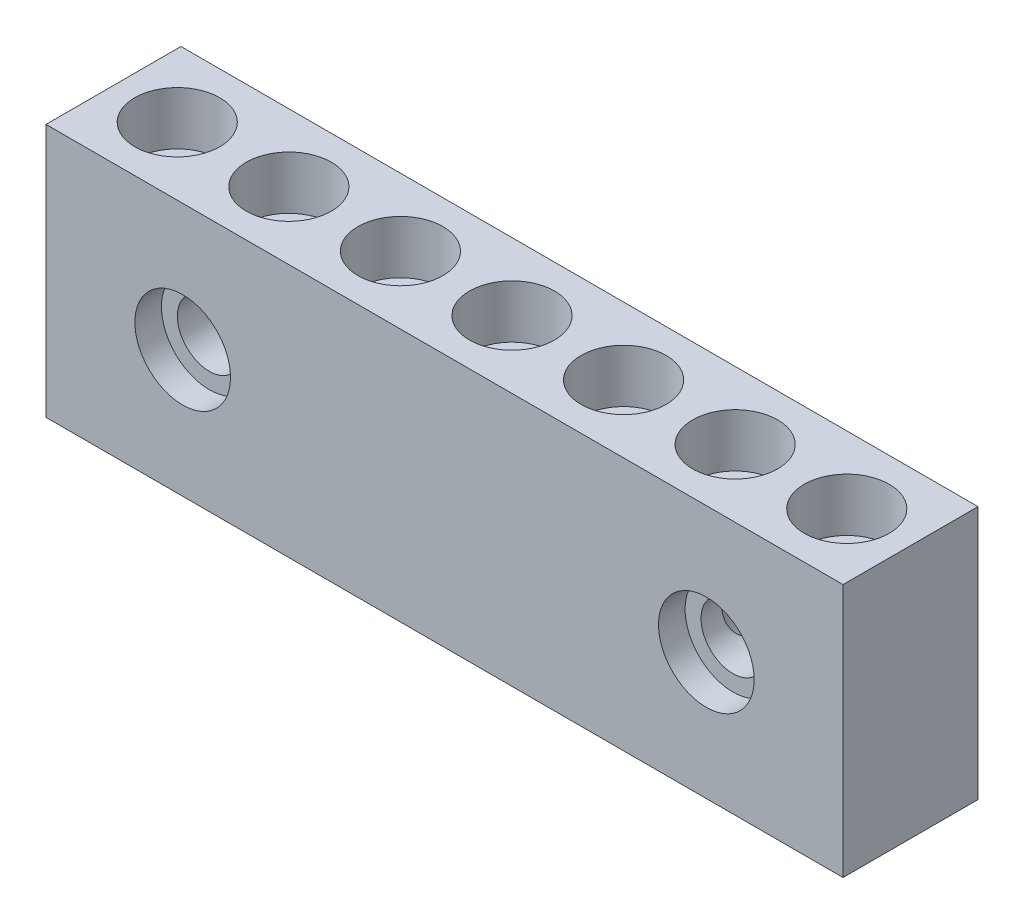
ISO-10303-21;
HEADER;
FILE_DESCRIPTION(('STEP AP214'),'2;1');
FILE_NAME('part.step','',(''),(''),'','','');
FILE_SCHEMA(('AUTOMOTIVE_DESIGN { 1 0 10303 214 1 1 1 1 }'));
ENDSEC;
DATA;
#1=APPLICATION_CONTEXT('core data for automotive mechanical design processes');
#2=APPLICATION_PROTOCOL_DEFINITION('international standard','automotive_design',2000,#1);
#3=PRODUCT_CONTEXT('',#1,'mechanical');
#4=PRODUCT('Part','Part','',(#3));
#5=PRODUCT_RELATED_PRODUCT_CATEGORY('part','',(#4));
#6=PRODUCT_DEFINITION_FORMATION('','',#4);
#7=PRODUCT_DEFINITION_CONTEXT('part definition',#1,'design');
#8=PRODUCT_DEFINITION('design','',#6,#7);
#9=PRODUCT_DEFINITION_SHAPE('','',#8);
#10=(LENGTH_UNIT() NAMED_UNIT(*) SI_UNIT(.MILLI.,.METRE.));
#11=(NAMED_UNIT(*) PLANE_ANGLE_UNIT() SI_UNIT($,.RADIAN.));
#12=(NAMED_UNIT(*) SI_UNIT($,.STERADIAN.) SOLID_ANGLE_UNIT());
#13=UNCERTAINTY_MEASURE_WITH_UNIT(LENGTH_MEASURE(1.E-05),#10,'distance_accuracy_value','');
#14=(GEOMETRIC_REPRESENTATION_CONTEXT(3) GLOBAL_UNCERTAINTY_ASSIGNED_CONTEXT((#13)) GLOBAL_UNIT_ASSIGNED_CONTEXT((#10,
#11,#12)) REPRESENTATION_CONTEXT('',''));
#15=CARTESIAN_POINT('',(0.,0.,0.));
#16=DIRECTION('',(0.,0.,1.));
#17=DIRECTION('',(1.,0.,0.));
#18=AXIS2_PLACEMENT_3D('',#15,#16,#17);
#19=CARTESIAN_POINT('',(-75.,-23.875,12.7));
#20=DIRECTION('',(1.,0.,0.));
#21=DIRECTION('',(0.,0.,-1.));
#22=AXIS2_PLACEMENT_3D('',#19,#20,#21);
#23=PLANE('',#22);
#24=DIRECTION('',(0.,-1.,0.));
#25=VECTOR('',#24,1.);
#26=CARTESIAN_POINT('',(-75.,-23.875,-12.7));
#27=LINE('',#26,#25);
#28=CARTESIAN_POINT('',(-75.,23.875,-12.7));
#29=VERTEX_POINT('',#28);
#30=CARTESIAN_POINT('',(-75.,-23.875,-12.7));
#31=VERTEX_POINT('',#30);
#32=EDGE_CURVE('E115',#29,#31,#27,.T.);
#33=ORIENTED_EDGE('',*,*,#32,.T.);
#34=DIRECTION('',(0.,0.,-1.));
#35=VECTOR('',#34,1.);
#36=CARTESIAN_POINT('',(-75.,-23.875,12.7));
#37=LINE('',#36,#35);
#38=CARTESIAN_POINT('',(-75.,-23.875,12.7));
#39=VERTEX_POINT('',#38);
#40=EDGE_CURVE('E11',#39,#31,#37,.T.);
#41=ORIENTED_EDGE('',*,*,#40,.F.);
#42=DIRECTION('',(0.,-1.,0.));
#43=VECTOR('',#42,1.);
#44=CARTESIAN_POINT('',(-75.,-23.875,12.7));
#45=LINE('',#44,#43);
#46=CARTESIAN_POINT('',(-75.,23.875,12.7));
#47=VERTEX_POINT('',#46);
#48=EDGE_CURVE('E96',#47,#39,#45,.T.);
#49=ORIENTED_EDGE('',*,*,#48,.F.);
#50=DIRECTION('',(0.,0.,-1.));
#51=VECTOR('',#50,1.);
#52=CARTESIAN_POINT('',(-75.,23.875,12.7));
#53=LINE('',#52,#51);
#54=EDGE_CURVE('E111',#47,#29,#53,.T.);
#55=ORIENTED_EDGE('',*,*,#54,.T.);
#56=EDGE_LOOP('',(#33,#41,#49,#55));
#57=FACE_BOUND('',#56,.T.);
#58=ADVANCED_FACE('F38',(#57),#23,.F.);
#59=CARTESIAN_POINT('',(75.,-23.875,12.7));
#60=DIRECTION('',(0.,1.,0.));
#61=DIRECTION('',(-1.,0.,0.));
#62=AXIS2_PLACEMENT_3D('',#59,#60,#61);
#63=PLANE('',#62);
#64=CARTESIAN_POINT('',(-42.,-23.875,0.));
#65=DIRECTION('',(0.,1.,0.));
#66=DIRECTION('',(-1.,0.,0.));
#67=AXIS2_PLACEMENT_3D('',#64,#65,#66);
#68=CIRCLE('',#67,4.00000000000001);
#69=CARTESIAN_POINT('',(-46.,-23.875,0.));
#70=VERTEX_POINT('',#69);
#71=EDGE_CURVE('E136',#70,#70,#68,.F.);
#72=ORIENTED_EDGE('',*,*,#71,.F.);
#73=EDGE_LOOP('',(#72));
#74=FACE_BOUND('',#73,.T.);
#75=CARTESIAN_POINT('',(-21.,-23.875,0.));
#76=DIRECTION('',(0.,1.,0.));
#77=DIRECTION('',(-1.,0.,0.));
#78=AXIS2_PLACEMENT_3D('',#75,#76,#77);
#79=CIRCLE('',#78,4.00000000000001);
#80=CARTESIAN_POINT('',(-25.,-23.875,0.));
#81=VERTEX_POINT('',#80);
#82=EDGE_CURVE('E568',#81,#81,#79,.F.);
#83=ORIENTED_EDGE('',*,*,#82,.F.);
#84=EDGE_LOOP('',(#83));
#85=FACE_BOUND('',#84,.T.);
#86=CARTESIAN_POINT('',(0.,-23.875,0.));
#87=DIRECTION('',(0.,1.,0.));
#88=DIRECTION('',(-1.,0.,0.));
#89=AXIS2_PLACEMENT_3D('',#86,#87,#88);
#90=CIRCLE('',#89,4.00000000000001);
#91=CARTESIAN_POINT('',(-4.00000000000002,-23.875,0.));
#92=VERTEX_POINT('',#91);
#93=EDGE_CURVE('E581',#92,#92,#90,.F.);
#94=ORIENTED_EDGE('',*,*,#93,.F.);
#95=EDGE_LOOP('',(#94));
#96=FACE_BOUND('',#95,.T.);
#97=CARTESIAN_POINT('',(21.,-23.875,0.));
#98=DIRECTION('',(0.,1.,0.));
#99=DIRECTION('',(-1.,0.,0.));
#100=AXIS2_PLACEMENT_3D('',#97,#98,#99);
#101=CIRCLE('',#100,4.00000000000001);
#102=CARTESIAN_POINT('',(17.,-23.875,0.));
#103=VERTEX_POINT('',#102);
#104=EDGE_CURVE('E631',#103,#103,#101,.F.);
#105=ORIENTED_EDGE('',*,*,#104,.F.);
#106=EDGE_LOOP('',(#105));
#107=FACE_BOUND('',#106,.T.);
#108=CARTESIAN_POINT('',(42.,-23.875,0.));
#109=DIRECTION('',(0.,1.,0.));
#110=DIRECTION('',(-1.,0.,0.));
#111=AXIS2_PLACEMENT_3D('',#108,#109,#110);
#112=CIRCLE('',#111,4.00000000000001);
#113=CARTESIAN_POINT('',(38.,-23.875,0.));
#114=VERTEX_POINT('',#113);
#115=EDGE_CURVE('E575',#114,#114,#112,.F.);
#116=ORIENTED_EDGE('',*,*,#115,.F.);
#117=EDGE_LOOP('',(#116));
#118=FACE_BOUND('',#117,.T.);
#119=CARTESIAN_POINT('',(63.,-23.875,0.));
#120=DIRECTION('',(0.,1.,0.));
#121=DIRECTION('',(-1.,0.,0.));
#122=AXIS2_PLACEMENT_3D('',#119,#120,#121);
#123=CIRCLE('',#122,4.00000000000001);
#124=CARTESIAN_POINT('',(59.,-23.875,0.));
#125=VERTEX_POINT('',#124);
#126=EDGE_CURVE('E545',#125,#125,#123,.F.);
#127=ORIENTED_EDGE('',*,*,#126,.F.);
#128=EDGE_LOOP('',(#127));
#129=FACE_BOUND('',#128,.T.);
#130=CARTESIAN_POINT('',(-63.,-23.875,0.));
#131=DIRECTION('',(0.,1.,0.));
#132=DIRECTION('',(-1.,0.,0.));
#133=AXIS2_PLACEMENT_3D('',#130,#131,#132);
#134=CIRCLE('',#133,4.00000000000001);
#135=CARTESIAN_POINT('',(-67.,-23.875,0.));
#136=VERTEX_POINT('',#135);
#137=EDGE_CURVE('E556',#136,#136,#134,.F.);
#138=ORIENTED_EDGE('',*,*,#137,.F.);
#139=EDGE_LOOP('',(#138));
#140=FACE_BOUND('',#139,.T.);
#141=DIRECTION('',(1.,0.,0.));
#142=VECTOR('',#141,1.);
#143=CARTESIAN_POINT('',(75.,-23.875,-12.7));
#144=LINE('',#143,#142);
#145=CARTESIAN_POINT('',(75.,-23.875,-12.7));
#146=VERTEX_POINT('',#145);
#147=EDGE_CURVE('E101',#31,#146,#144,.T.);
#148=ORIENTED_EDGE('',*,*,#147,.T.);
#149=DIRECTION('',(0.,0.,-1.));
#150=VECTOR('',#149,1.);
#151=CARTESIAN_POINT('',(75.,-23.875,12.7));
#152=LINE('',#151,#150);
#153=CARTESIAN_POINT('',(75.,-23.875,12.7));
#154=VERTEX_POINT('',#153);
#155=EDGE_CURVE('E52',#154,#146,#152,.T.);
#156=ORIENTED_EDGE('',*,*,#155,.F.);
#157=DIRECTION('',(1.,0.,0.));
#158=VECTOR('',#157,1.);
#159=CARTESIAN_POINT('',(75.,-23.875,12.7));
#160=LINE('',#159,#158);
#161=EDGE_CURVE('E91',#39,#154,#160,.T.);
#162=ORIENTED_EDGE('',*,*,#161,.F.);
#163=ORIENTED_EDGE('',*,*,#40,.T.);
#164=EDGE_LOOP('',(#148,#156,#162,#163));
#165=FACE_BOUND('',#164,.T.);
#166=ADVANCED_FACE('F100',(#74,#85,#96,#107,#118,#129,#140,#165),#63,.F.);
#167=CARTESIAN_POINT('',(75.,-23.875,12.7));
#168=DIRECTION('',(-1.,0.,0.));
#169=DIRECTION('',(0.,0.,1.));
#170=AXIS2_PLACEMENT_3D('',#167,#168,#169);
#171=PLANE('',#170);
#172=DIRECTION('',(0.,1.,0.));
#173=VECTOR('',#172,1.);
#174=CARTESIAN_POINT('',(75.,-23.875,-12.7));
#175=LINE('',#174,#173);
#176=CARTESIAN_POINT('',(75.,23.875,-12.7));
#177=VERTEX_POINT('',#176);
#178=EDGE_CURVE('E78',#146,#177,#175,.T.);
#179=ORIENTED_EDGE('',*,*,#178,.T.);
#180=DIRECTION('',(0.,0.,-1.));
#181=VECTOR('',#180,1.);
#182=CARTESIAN_POINT('',(75.,23.875,12.7));
#183=LINE('',#182,#181);
#184=CARTESIAN_POINT('',(75.,23.875,12.7));
#185=VERTEX_POINT('',#184);
#186=EDGE_CURVE('E103',#185,#177,#183,.T.);
#187=ORIENTED_EDGE('',*,*,#186,.F.);
#188=DIRECTION('',(0.,1.,0.));
#189=VECTOR('',#188,1.);
#190=CARTESIAN_POINT('',(75.,-23.875,12.7));
#191=LINE('',#190,#189);
#192=EDGE_CURVE('E94',#154,#185,#191,.T.);
#193=ORIENTED_EDGE('',*,*,#192,.F.);
#194=ORIENTED_EDGE('',*,*,#155,.T.);
#195=EDGE_LOOP('',(#179,#187,#193,#194));
#196=FACE_BOUND('',#195,.T.);
#197=ADVANCED_FACE('F105',(#196),#171,.F.);
#198=CARTESIAN_POINT('',(75.,23.875,12.7));
#199=DIRECTION('',(0.,-1.,0.));
#200=DIRECTION('',(1.,0.,0.));
#201=AXIS2_PLACEMENT_3D('',#198,#199,#200);
#202=PLANE('',#201);
#203=CARTESIAN_POINT('',(-42.,23.875,0.));
#204=DIRECTION('',(0.,1.,0.));
#205=DIRECTION('',(-1.,0.,0.));
#206=AXIS2_PLACEMENT_3D('',#203,#204,#205);
#207=CIRCLE('',#206,7.99999999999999);
#208=CARTESIAN_POINT('',(-50.,23.875,0.));
#209=VERTEX_POINT('',#208);
#210=EDGE_CURVE('E587',#209,#209,#207,.T.);
#211=ORIENTED_EDGE('',*,*,#210,.F.);
#212=EDGE_LOOP('',(#211));
#213=FACE_BOUND('',#212,.T.);
#214=CARTESIAN_POINT('',(-21.,23.875,0.));
#215=DIRECTION('',(0.,1.,0.));
#216=DIRECTION('',(-1.,0.,0.));
#217=AXIS2_PLACEMENT_3D('',#214,#215,#216);
#218=CIRCLE('',#217,7.99999999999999);
#219=CARTESIAN_POINT('',(-29.,23.875,0.));
#220=VERTEX_POINT('',#219);
#221=EDGE_CURVE('E588',#220,#220,#218,.T.);
#222=ORIENTED_EDGE('',*,*,#221,.F.);
#223=EDGE_LOOP('',(#222));
#224=FACE_BOUND('',#223,.T.);
#225=CARTESIAN_POINT('',(0.,23.875,0.));
#226=DIRECTION('',(0.,1.,0.));
#227=DIRECTION('',(-1.,0.,0.));
#228=AXIS2_PLACEMENT_3D('',#225,#226,#227);
#229=CIRCLE('',#228,7.99999999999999);
#230=CARTESIAN_POINT('',(-8.,23.875,0.));
#231=VERTEX_POINT('',#230);
#232=EDGE_CURVE('E541',#231,#231,#229,.T.);
#233=ORIENTED_EDGE('',*,*,#232,.F.);
#234=EDGE_LOOP('',(#233));
#235=FACE_BOUND('',#234,.T.);
#236=CARTESIAN_POINT('',(21.,23.875,0.));
#237=DIRECTION('',(0.,1.,0.));
#238=DIRECTION('',(-1.,0.,0.));
#239=AXIS2_PLACEMENT_3D('',#236,#237,#238);
#240=CIRCLE('',#239,7.99999999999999);
#241=CARTESIAN_POINT('',(13.,23.875,0.));
#242=VERTEX_POINT('',#241);
#243=EDGE_CURVE('E542',#242,#242,#240,.T.);
#244=ORIENTED_EDGE('',*,*,#243,.F.);
#245=EDGE_LOOP('',(#244));
#246=FACE_BOUND('',#245,.T.);
#247=CARTESIAN_POINT('',(42.,23.875,0.));
#248=DIRECTION('',(0.,1.,0.));
#249=DIRECTION('',(-1.,0.,0.));
#250=AXIS2_PLACEMENT_3D('',#247,#248,#249);
#251=CIRCLE('',#250,7.99999999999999);
#252=CARTESIAN_POINT('',(34.,23.875,0.));
#253=VERTEX_POINT('',#252);
#254=EDGE_CURVE('E566',#253,#253,#251,.T.);
#255=ORIENTED_EDGE('',*,*,#254,.F.);
#256=EDGE_LOOP('',(#255));
#257=FACE_BOUND('',#256,.T.);
#258=CARTESIAN_POINT('',(63.,23.875,0.));
#259=DIRECTION('',(0.,1.,0.));
#260=DIRECTION('',(-1.,0.,0.));
#261=AXIS2_PLACEMENT_3D('',#258,#259,#260);
#262=CIRCLE('',#261,7.99999999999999);
#263=CARTESIAN_POINT('',(55.,23.875,0.));
#264=VERTEX_POINT('',#263);
#265=EDGE_CURVE('E551',#264,#264,#262,.T.);
#266=ORIENTED_EDGE('',*,*,#265,.F.);
#267=EDGE_LOOP('',(#266));
#268=FACE_BOUND('',#267,.T.);
#269=CARTESIAN_POINT('',(-63.,23.875,0.));
#270=DIRECTION('',(0.,1.,0.));
#271=DIRECTION('',(-1.,0.,0.));
#272=AXIS2_PLACEMENT_3D('',#269,#270,#271);
#273=CIRCLE('',#272,7.99999999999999);
#274=CARTESIAN_POINT('',(-71.,23.875,0.));
#275=VERTEX_POINT('',#274);
#276=EDGE_CURVE('E518',#275,#275,#273,.T.);
#277=ORIENTED_EDGE('',*,*,#276,.F.);
#278=EDGE_LOOP('',(#277));
#279=FACE_BOUND('',#278,.T.);
#280=DIRECTION('',(-1.,0.,0.));
#281=VECTOR('',#280,1.);
#282=CARTESIAN_POINT('',(75.,23.875,-12.7));
#283=LINE('',#282,#281);
#284=EDGE_CURVE('E84',#177,#29,#283,.T.);
#285=ORIENTED_EDGE('',*,*,#284,.T.);
#286=ORIENTED_EDGE('',*,*,#54,.F.);
#287=DIRECTION('',(-1.,0.,0.));
#288=VECTOR('',#287,1.);
#289=CARTESIAN_POINT('',(75.,23.875,12.7));
#290=LINE('',#289,#288);
#291=EDGE_CURVE('E61',#185,#47,#290,.T.);
#292=ORIENTED_EDGE('',*,*,#291,.F.);
#293=ORIENTED_EDGE('',*,*,#186,.T.);
#294=EDGE_LOOP('',(#285,#286,#292,#293));
#295=FACE_BOUND('',#294,.T.);
#296=ADVANCED_FACE('F250',(#213,#224,#235,#246,#257,#268,#279,#295),#202,.F.);
#297=CARTESIAN_POINT('',(0.,0.,12.7));
#298=DIRECTION('',(0.,0.,1.));
#299=DIRECTION('',(1.,0.,0.));
#300=AXIS2_PLACEMENT_3D('',#297,#298,#299);
#301=PLANE('',#300);
#302=CARTESIAN_POINT('',(-49.275,-0.00500000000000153,12.7));
#303=DIRECTION('',(0.,0.,1.));
#304=DIRECTION('',(1.,0.,0.));
#305=AXIS2_PLACEMENT_3D('',#302,#303,#304);
#306=CIRCLE('',#305,9.00000000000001);
#307=CARTESIAN_POINT('',(-40.275,-0.00500000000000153,12.7));
#308=VERTEX_POINT('',#307);
#309=EDGE_CURVE('E527',#308,#308,#306,.T.);
#310=ORIENTED_EDGE('',*,*,#309,.F.);
#311=EDGE_LOOP('',(#310));
#312=FACE_BOUND('',#311,.T.);
#313=CARTESIAN_POINT('',(49.275,-0.00500000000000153,12.7));
#314=DIRECTION('',(0.,0.,1.));
#315=DIRECTION('',(1.,0.,0.));
#316=AXIS2_PLACEMENT_3D('',#313,#314,#315);
#317=CIRCLE('',#316,9.);
#318=CARTESIAN_POINT('',(58.275,-0.00500000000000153,12.7));
#319=VERTEX_POINT('',#318);
#320=EDGE_CURVE('E535',#319,#319,#317,.T.);
#321=ORIENTED_EDGE('',*,*,#320,.F.);
#322=EDGE_LOOP('',(#321));
#323=FACE_BOUND('',#322,.T.);
#324=ORIENTED_EDGE('',*,*,#48,.T.);
#325=ORIENTED_EDGE('',*,*,#161,.T.);
#326=ORIENTED_EDGE('',*,*,#192,.T.);
#327=ORIENTED_EDGE('',*,*,#291,.T.);
#328=EDGE_LOOP('',(#324,#325,#326,#327));
#329=FACE_BOUND('',#328,.T.);
#330=ADVANCED_FACE('F92',(#312,#323,#329),#301,.T.);
#331=CARTESIAN_POINT('',(0.,0.,-12.7));
#332=DIRECTION('',(0.,0.,1.));
#333=DIRECTION('',(1.,0.,0.));
#334=AXIS2_PLACEMENT_3D('',#331,#332,#333);
#335=PLANE('',#334);
#336=CARTESIAN_POINT('',(-49.275,-0.00500000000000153,-12.7));
#337=DIRECTION('',(0.,0.,1.));
#338=DIRECTION('',(1.,0.,0.));
#339=AXIS2_PLACEMENT_3D('',#336,#337,#338);
#340=CIRCLE('',#339,6.);
#341=CARTESIAN_POINT('',(-43.275,-0.00500000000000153,-12.7));
#342=VERTEX_POINT('',#341);
#343=EDGE_CURVE('E521',#342,#342,#340,.F.);
#344=ORIENTED_EDGE('',*,*,#343,.F.);
#345=EDGE_LOOP('',(#344));
#346=FACE_BOUND('',#345,.T.);
#347=CARTESIAN_POINT('',(49.275,-0.00500000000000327,-12.7));
#348=DIRECTION('',(0.,0.,1.));
#349=DIRECTION('',(1.,0.,0.));
#350=AXIS2_PLACEMENT_3D('',#347,#348,#349);
#351=CIRCLE('',#350,6.);
#352=CARTESIAN_POINT('',(55.275,-0.00500000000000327,-12.7));
#353=VERTEX_POINT('',#352);
#354=EDGE_CURVE('E505',#353,#353,#351,.F.);
#355=ORIENTED_EDGE('',*,*,#354,.F.);
#356=EDGE_LOOP('',(#355));
#357=FACE_BOUND('',#356,.T.);
#358=ORIENTED_EDGE('',*,*,#32,.F.);
#359=ORIENTED_EDGE('',*,*,#284,.F.);
#360=ORIENTED_EDGE('',*,*,#178,.F.);
#361=ORIENTED_EDGE('',*,*,#147,.F.);
#362=EDGE_LOOP('',(#358,#359,#360,#361));
#363=FACE_BOUND('',#362,.T.);
#364=ADVANCED_FACE('F238',(#346,#357,#363),#335,.F.);
#365=CARTESIAN_POINT('',(49.275,-0.00500000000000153,7.7));
#366=DIRECTION('',(0.,0.,1.));
#367=DIRECTION('',(1.,0.,0.));
#368=AXIS2_PLACEMENT_3D('',#365,#366,#367);
#369=CYLINDRICAL_SURFACE('',#368,9.);
#370=CARTESIAN_POINT('',(49.275,-0.00500000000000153,7.7));
#371=DIRECTION('',(0.,0.,1.));
#372=DIRECTION('',(1.,0.,0.));
#373=AXIS2_PLACEMENT_3D('',#370,#371,#372);
#374=CIRCLE('',#373,9.);
#375=CARTESIAN_POINT('',(58.275,-0.00500000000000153,7.7));
#376=VERTEX_POINT('',#375);
#377=EDGE_CURVE('E531',#376,#376,#374,.T.);
#378=ORIENTED_EDGE('',*,*,#377,.F.);
#379=EDGE_LOOP('',(#378));
#380=FACE_BOUND('',#379,.T.);
#381=ORIENTED_EDGE('',*,*,#320,.T.);
#382=EDGE_LOOP('',(#381));
#383=FACE_BOUND('',#382,.T.);
#384=ADVANCED_FACE('F240',(#380,#383),#369,.F.);
#385=CARTESIAN_POINT('',(49.275,-0.00500000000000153,7.7));
#386=DIRECTION('',(0.,0.,1.));
#387=DIRECTION('',(1.,0.,0.));
#388=AXIS2_PLACEMENT_3D('',#385,#386,#387);
#389=PLANE('',#388);
#390=CARTESIAN_POINT('',(49.275,-0.00500000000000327,7.7));
#391=DIRECTION('',(0.,0.,1.));
#392=DIRECTION('',(1.,0.,0.));
#393=AXIS2_PLACEMENT_3D('',#390,#391,#392);
#394=CIRCLE('',#393,6.);
#395=CARTESIAN_POINT('',(55.275,-0.00500000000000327,7.7));
#396=VERTEX_POINT('',#395);
#397=EDGE_CURVE('E508',#396,#396,#394,.T.);
#398=ORIENTED_EDGE('',*,*,#397,.F.);
#399=EDGE_LOOP('',(#398));
#400=FACE_BOUND('',#399,.T.);
#401=ORIENTED_EDGE('',*,*,#377,.T.);
#402=EDGE_LOOP('',(#401));
#403=FACE_BOUND('',#402,.T.);
#404=ADVANCED_FACE('F247',(#400,#403),#389,.T.);
#405=CARTESIAN_POINT('',(-49.275,-0.00500000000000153,7.7));
#406=DIRECTION('',(0.,0.,1.));
#407=DIRECTION('',(1.,0.,0.));
#408=AXIS2_PLACEMENT_3D('',#405,#406,#407);
#409=CYLINDRICAL_SURFACE('',#408,9.00000000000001);
#410=CARTESIAN_POINT('',(-49.275,-0.00500000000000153,7.7));
#411=DIRECTION('',(0.,0.,1.));
#412=DIRECTION('',(1.,0.,0.));
#413=AXIS2_PLACEMENT_3D('',#410,#411,#412);
#414=CIRCLE('',#413,9.00000000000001);
#415=CARTESIAN_POINT('',(-40.275,-0.00500000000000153,7.7));
#416=VERTEX_POINT('',#415);
#417=EDGE_CURVE('E119',#416,#416,#414,.T.);
#418=ORIENTED_EDGE('',*,*,#417,.F.);
#419=EDGE_LOOP('',(#418));
#420=FACE_BOUND('',#419,.T.);
#421=ORIENTED_EDGE('',*,*,#309,.T.);
#422=EDGE_LOOP('',(#421));
#423=FACE_BOUND('',#422,.T.);
#424=ADVANCED_FACE('F286',(#420,#423),#409,.F.);
#425=CARTESIAN_POINT('',(-49.275,-0.00500000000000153,7.7));
#426=DIRECTION('',(0.,0.,1.));
#427=DIRECTION('',(1.,0.,0.));
#428=AXIS2_PLACEMENT_3D('',#425,#426,#427);
#429=PLANE('',#428);
#430=CARTESIAN_POINT('',(-49.275,-0.00500000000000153,7.7));
#431=DIRECTION('',(0.,0.,1.));
#432=DIRECTION('',(1.,0.,0.));
#433=AXIS2_PLACEMENT_3D('',#430,#431,#432);
#434=CIRCLE('',#433,6.);
#435=CARTESIAN_POINT('',(-43.275,-0.00500000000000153,7.7));
#436=VERTEX_POINT('',#435);
#437=EDGE_CURVE('E514',#436,#436,#434,.T.);
#438=ORIENTED_EDGE('',*,*,#437,.F.);
#439=EDGE_LOOP('',(#438));
#440=FACE_BOUND('',#439,.T.);
#441=ORIENTED_EDGE('',*,*,#417,.T.);
#442=EDGE_LOOP('',(#441));
#443=FACE_BOUND('',#442,.T.);
#444=ADVANCED_FACE('F295',(#440,#443),#429,.T.);
#445=CARTESIAN_POINT('',(49.275,-0.00500000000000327,-29.6705627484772));
#446=DIRECTION('',(0.,0.,1.));
#447=DIRECTION('',(1.,0.,0.));
#448=AXIS2_PLACEMENT_3D('',#445,#446,#447);
#449=CYLINDRICAL_SURFACE('',#448,6.);
#450=CARTESIAN_POINT('',(43.275,-0.0050000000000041,-3.7913552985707));
#451=CARTESIAN_POINT('',(43.2750012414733,-0.175367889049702,-3.79135752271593));
#452=CARTESIAN_POINT('',(43.2822641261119,-0.34576269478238,-3.7889363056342));
#453=CARTESIAN_POINT('',(43.3112478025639,-0.68521380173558,-3.77900237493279));
#454=CARTESIAN_POINT('',(43.3329731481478,-0.85426966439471,-3.77148805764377));
#455=CARTESIAN_POINT('',(43.3906445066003,-1.18961348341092,-3.75060652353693));
#456=CARTESIAN_POINT('',(43.4265932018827,-1.35590091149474,-3.73723820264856));
#457=CARTESIAN_POINT('',(43.5122507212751,-1.68412459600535,-3.70340668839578));
#458=CARTESIAN_POINT('',(43.5619545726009,-1.84606240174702,-3.68294605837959));
#459=CARTESIAN_POINT('',(43.6607146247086,-2.12540670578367,-3.63925538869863));
#460=CARTESIAN_POINT('',(43.707006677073,-2.24409154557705,-3.61789922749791));
#461=CARTESIAN_POINT('',(43.806540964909,-2.4772478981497,-3.56924088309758));
#462=CARTESIAN_POINT('',(43.8597817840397,-2.59172026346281,-3.54193991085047));
#463=CARTESIAN_POINT('',(43.9724420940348,-2.81543408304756,-3.48045712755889));
#464=CARTESIAN_POINT('',(44.0318513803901,-2.92468375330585,-3.44628659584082));
#465=CARTESIAN_POINT('',(44.1559928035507,-3.13723551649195,-3.37001453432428));
#466=CARTESIAN_POINT('',(44.2207239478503,-3.24053871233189,-3.32791448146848));
#467=CARTESIAN_POINT('',(44.3419118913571,-3.42175766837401,-3.24343109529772));
#468=CARTESIAN_POINT('',(44.3976814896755,-3.50083247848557,-3.20254360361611));
#469=CARTESIAN_POINT('',(44.5111159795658,-3.65390080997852,-3.11439453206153));
#470=CARTESIAN_POINT('',(44.5687805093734,-3.72789529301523,-3.06713416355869));
#471=CARTESIAN_POINT('',(44.6850385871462,-3.87032061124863,-2.96589036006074));
#472=CARTESIAN_POINT('',(44.7436318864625,-3.93875290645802,-2.91190869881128));
#473=CARTESIAN_POINT('',(44.8606814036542,-4.06966501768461,-2.7970029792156));
#474=CARTESIAN_POINT('',(44.9191376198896,-4.1321447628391,-2.7360788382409));
#475=CARTESIAN_POINT('',(45.0350796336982,-4.2511771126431,-2.60688823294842));
#476=CARTESIAN_POINT('',(45.0925577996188,-4.3076930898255,-2.53858108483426));
#477=CARTESIAN_POINT('',(45.2049614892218,-4.4141702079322,-2.39510423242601));
#478=CARTESIAN_POINT('',(45.2598872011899,-4.46413183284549,-2.3199350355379));
#479=CARTESIAN_POINT('',(45.3659900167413,-4.55743174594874,-2.16311650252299));
#480=CARTESIAN_POINT('',(45.4171671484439,-4.60077008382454,-2.08146721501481));
#481=CARTESIAN_POINT('',(45.5146554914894,-4.68087344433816,-1.91225722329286));
#482=CARTESIAN_POINT('',(45.5609671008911,-4.71763900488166,-1.8246970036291));
#483=CARTESIAN_POINT('',(45.6434123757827,-4.78140144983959,-1.65337934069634));
#484=CARTESIAN_POINT('',(45.68010048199,-4.80900692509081,-1.57011371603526));
#485=CARTESIAN_POINT('',(45.7481458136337,-4.85918256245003,-1.39992954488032));
#486=CARTESIAN_POINT('',(45.779501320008,-4.8817511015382,-1.31300983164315));
#487=CARTESIAN_POINT('',(45.8363561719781,-4.92200546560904,-1.13621752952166));
#488=CARTESIAN_POINT('',(45.8618578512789,-4.93969323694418,-1.04634613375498));
#489=CARTESIAN_POINT('',(45.9066445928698,-4.97037195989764,-0.864247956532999));
#490=CARTESIAN_POINT('',(45.9259273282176,-4.98336115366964,-0.772020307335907));
#491=CARTESIAN_POINT('',(45.957696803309,-5.00458616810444,-0.587565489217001));
#492=CARTESIAN_POINT('',(45.970298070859,-5.0129022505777,-0.495367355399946));
#493=CARTESIAN_POINT('',(45.9890577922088,-5.02522867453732,-0.310023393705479));
#494=CARTESIAN_POINT('',(45.995213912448,-5.02923745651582,-0.216877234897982));
#495=CARTESIAN_POINT('',(46.003841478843,-5.03487823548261,0.0629388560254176));
#496=CARTESIAN_POINT('',(45.996505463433,-5.03014632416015,0.250179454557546));
#497=CARTESIAN_POINT('',(45.9558000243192,-5.00334740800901,0.622082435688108));
#498=CARTESIAN_POINT('',(45.9222092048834,-4.98113296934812,0.806709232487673));
#499=CARTESIAN_POINT('',(45.8306202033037,-4.91817802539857,1.16652065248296));
#500=CARTESIAN_POINT('',(45.7726255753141,-4.87744021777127,1.3417066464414));
#501=CARTESIAN_POINT('',(45.6361375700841,-4.77635244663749,1.67660905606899));
#502=CARTESIAN_POINT('',(45.5577618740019,-4.71611460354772,1.83640729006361));
#503=CARTESIAN_POINT('',(45.3855227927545,-4.57493500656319,2.13735642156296));
#504=CARTESIAN_POINT('',(45.2916628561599,-4.49399786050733,2.2785114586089));
#505=CARTESIAN_POINT('',(45.094952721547,-4.31140746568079,2.53928279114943));
#506=CARTESIAN_POINT('',(44.9921081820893,-4.20976720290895,2.6589125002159));
#507=CARTESIAN_POINT('',(44.7842034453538,-3.98695328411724,2.87590673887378));
#508=CARTESIAN_POINT('',(44.6791426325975,-3.86577413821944,2.97326499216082));
#509=CARTESIAN_POINT('',(44.4658913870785,-3.59719471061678,3.15280368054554));
#510=CARTESIAN_POINT('',(44.3579891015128,-3.44855887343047,3.23346353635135));
#511=CARTESIAN_POINT('',(44.1526532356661,-3.13497120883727,3.37366184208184));
#512=CARTESIAN_POINT('',(44.0552258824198,-2.97000978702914,3.4331877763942));
#513=CARTESIAN_POINT('',(43.9121198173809,-2.69805364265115,3.51389849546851));
#514=CARTESIAN_POINT('',(43.8616527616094,-2.59516251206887,3.54077776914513));
#515=CARTESIAN_POINT('',(43.7662855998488,-2.38560901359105,3.58930380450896));
#516=CARTESIAN_POINT('',(43.7213860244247,-2.27894628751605,3.61095006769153));
#517=CARTESIAN_POINT('',(43.6375857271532,-2.06243764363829,3.64971855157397));
#518=CARTESIAN_POINT('',(43.5986880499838,-1.95259014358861,3.66683847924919));
#519=CARTESIAN_POINT('',(43.5272269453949,-1.73032175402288,3.6971723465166));
#520=CARTESIAN_POINT('',(43.4946641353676,-1.61790061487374,3.71038590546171));
#521=CARTESIAN_POINT('',(43.4300440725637,-1.36752830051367,3.7358296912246));
#522=CARTESIAN_POINT('',(43.3994867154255,-1.22910948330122,3.74729019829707));
#523=CARTESIAN_POINT('',(43.3482170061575,-0.950176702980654,3.7660395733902));
#524=CARTESIAN_POINT('',(43.3275058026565,-0.809662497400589,3.77332795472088));
#525=CARTESIAN_POINT('',(43.2960856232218,-0.527280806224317,3.7842356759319));
#526=CARTESIAN_POINT('',(43.2853835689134,-0.385412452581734,3.78785247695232));
#527=CARTESIAN_POINT('',(43.2740863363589,-0.101230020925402,3.7916668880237));
#528=CARTESIAN_POINT('',(43.2734913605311,0.0410840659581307,3.7918644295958));
#529=CARTESIAN_POINT('',(43.2829073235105,0.341054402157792,3.78869144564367));
#530=CARTESIAN_POINT('',(43.2940955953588,0.498671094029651,3.78492487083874));
#531=CARTESIAN_POINT('',(43.3288420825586,0.812383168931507,3.77286567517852));
#532=CARTESIAN_POINT('',(43.3524020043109,0.968478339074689,3.76457242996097));
#533=CARTESIAN_POINT('',(43.4116531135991,1.27795761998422,3.74275727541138));
#534=CARTESIAN_POINT('',(43.4473422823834,1.43134217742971,3.72923623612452));
#535=CARTESIAN_POINT('',(43.5304495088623,1.7341888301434,3.69590726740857));
#536=CARTESIAN_POINT('',(43.577864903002,1.88365180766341,3.67610076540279));
#537=CARTESIAN_POINT('',(43.6738928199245,2.14993141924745,3.633221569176));
#538=CARTESIAN_POINT('',(43.7206314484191,2.26763620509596,3.61144773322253));
#539=CARTESIAN_POINT('',(43.8209334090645,2.49880134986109,3.56192792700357));
#540=CARTESIAN_POINT('',(43.8744955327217,2.61226245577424,3.53418301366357));
#541=CARTESIAN_POINT('',(43.9876808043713,2.83396567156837,3.47178543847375));
#542=CARTESIAN_POINT('',(44.0472958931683,2.94221444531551,3.43714190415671));
#543=CARTESIAN_POINT('',(44.1717078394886,3.15274387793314,3.35991683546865));
#544=CARTESIAN_POINT('',(44.2365036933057,3.25502568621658,3.31733683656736));
#545=CARTESIAN_POINT('',(44.3577555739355,3.43450438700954,3.2319385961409));
#546=CARTESIAN_POINT('',(44.4135531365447,3.5128546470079,3.19060502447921));
#547=CARTESIAN_POINT('',(44.5269478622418,3.66446258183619,3.10156867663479));
#548=CARTESIAN_POINT('',(44.5845446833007,3.73772121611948,3.05386710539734));
#549=CARTESIAN_POINT('',(44.7005651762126,3.87866788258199,2.95176473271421));
#550=CARTESIAN_POINT('',(44.7589885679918,3.94635775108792,2.89736615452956));
#551=CARTESIAN_POINT('',(44.8756017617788,4.07579453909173,2.7816647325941));
#552=CARTESIAN_POINT('',(44.9337915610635,4.13754138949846,2.72036180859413));
#553=CARTESIAN_POINT('',(45.049102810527,4.25511898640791,2.59047382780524));
#554=CARTESIAN_POINT('',(45.1062162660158,4.31091394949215,2.52184919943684));
#555=CARTESIAN_POINT('',(45.2178132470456,4.41598536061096,2.37780902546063));
#556=CARTESIAN_POINT('',(45.2722969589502,4.46526227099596,2.30239396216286));
#557=CARTESIAN_POINT('',(45.3774573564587,4.55724115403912,2.14516351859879));
#558=CARTESIAN_POINT('',(45.4281339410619,4.59994295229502,2.06334796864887));
#559=CARTESIAN_POINT('',(45.52458072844,4.67882745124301,1.89389333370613));
#560=CARTESIAN_POINT('',(45.5703513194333,4.71501066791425,1.80625471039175));
#561=CARTESIAN_POINT('',(45.6518406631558,4.77779193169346,1.63468079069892));
#562=CARTESIAN_POINT('',(45.6881044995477,4.80498087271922,1.55121916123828));
#563=CARTESIAN_POINT('',(45.7552727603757,4.85434760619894,1.3806974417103));
#564=CARTESIAN_POINT('',(45.7861754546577,4.87652378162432,1.29363620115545));
#565=CARTESIAN_POINT('',(45.8421063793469,4.91601760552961,1.11661612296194));
#566=CARTESIAN_POINT('',(45.8671369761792,4.93333721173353,1.02665846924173));
#567=CARTESIAN_POINT('',(45.9109723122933,4.96330178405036,0.844441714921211));
#568=CARTESIAN_POINT('',(45.9297747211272,4.97594500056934,0.752181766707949));
#569=CARTESIAN_POINT('',(45.9606115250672,4.99651685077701,0.567593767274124));
#570=CARTESIAN_POINT('',(45.9727521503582,5.00451960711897,0.475291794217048));
#571=CARTESIAN_POINT('',(45.9905797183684,5.01622328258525,0.289787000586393));
#572=CARTESIAN_POINT('',(45.9962643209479,5.01992264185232,0.196583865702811));
#573=CARTESIAN_POINT('',(46.0034707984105,5.02463573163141,-0.0833326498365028));
#574=CARTESIAN_POINT('',(45.9951776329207,5.01928543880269,-0.270546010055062));
#575=CARTESIAN_POINT('',(45.9525849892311,4.99121659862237,-0.642182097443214));
#576=CARTESIAN_POINT('',(45.9180672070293,4.96835224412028,-0.826568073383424));
#577=CARTESIAN_POINT('',(45.8247199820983,4.90404896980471,-1.18570590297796));
#578=CARTESIAN_POINT('',(45.7658942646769,4.86261289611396,-1.36045922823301));
#579=CARTESIAN_POINT('',(45.627924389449,4.7600954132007,-1.69428246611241));
#580=CARTESIAN_POINT('',(45.548902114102,4.69913131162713,-1.85343879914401));
#581=CARTESIAN_POINT('',(45.3755904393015,4.55648449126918,-2.15298140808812));
#582=CARTESIAN_POINT('',(45.2813042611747,4.47480614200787,-2.2933716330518));
#583=CARTESIAN_POINT('',(45.0839308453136,4.29070658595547,-2.55263518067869));
#584=CARTESIAN_POINT('',(44.9808436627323,4.18828550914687,-2.67150863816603));
#585=CARTESIAN_POINT('',(44.7726972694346,3.96396343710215,-2.88697737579));
#586=CARTESIAN_POINT('',(44.667637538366,3.84205723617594,-2.98356668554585));
#587=CARTESIAN_POINT('',(44.4544170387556,3.57182198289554,-3.16172853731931));
#588=CARTESIAN_POINT('',(44.3465677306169,3.42222987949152,-3.24174305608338));
#589=CARTESIAN_POINT('',(44.141554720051,3.10677770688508,-3.38070037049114));
#590=CARTESIAN_POINT('',(44.044398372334,2.94090658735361,-3.43962872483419));
#591=CARTESIAN_POINT('',(43.9017934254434,2.66741328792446,-3.51949351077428));
#592=CARTESIAN_POINT('',(43.8515025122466,2.563863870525,-3.54609119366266));
#593=CARTESIAN_POINT('',(43.7565631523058,2.35300866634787,-3.59406721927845));
#594=CARTESIAN_POINT('',(43.7119153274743,2.24570246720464,-3.61544498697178));
#595=CARTESIAN_POINT('',(43.6287057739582,2.02796707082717,-3.65368499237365));
#596=CARTESIAN_POINT('',(43.5901449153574,1.91753742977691,-3.67054658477));
#597=CARTESIAN_POINT('',(43.5194212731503,1.69412989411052,-3.70038267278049));
#598=CARTESIAN_POINT('',(43.4872589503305,1.58115181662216,-3.71335688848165));
#599=CARTESIAN_POINT('',(43.4281087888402,1.34744771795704,-3.73651784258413));
#600=CARTESIAN_POINT('',(43.4014630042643,1.22661799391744,-3.74653134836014));
#601=CARTESIAN_POINT('',(43.3556652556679,0.983331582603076,-3.76334506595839));
#602=CARTESIAN_POINT('',(43.3365132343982,0.860874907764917,-3.77014530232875));
#603=CARTESIAN_POINT('',(43.305808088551,0.614786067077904,-3.7808902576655));
#604=CARTESIAN_POINT('',(43.2942611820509,0.491153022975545,-3.78483264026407));
#605=CARTESIAN_POINT('',(43.2788563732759,0.243351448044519,-3.79006445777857));
#606=CARTESIAN_POINT('',(43.2749990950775,0.11918287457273,-3.79135367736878));
#607=CARTESIAN_POINT('',(43.275,-0.0050000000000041,-3.7913552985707));
#608=B_SPLINE_CURVE_WITH_KNOTS('',3,(#450,#451,#452,#453,#454,#455,#456,#457,#458,#459,#460,
#461,#462,#463,#464,#465,#466,#467,#468,#469,#470,#471,#472,#473,#474,#475,#476,#477,#478,#479,
#480,#481,#482,#483,#484,#485,#486,#487,#488,#489,#490,#491,#492,#493,#494,#495,#496,#497,#498,
#499,#500,#501,#502,#503,#504,#505,#506,#507,#508,#509,#510,#511,#512,#513,#514,#515,#516,#517,
#518,#519,#520,#521,#522,#523,#524,#525,#526,#527,#528,#529,#530,#531,#532,#533,#534,#535,#536,
#537,#538,#539,#540,#541,#542,#543,#544,#545,#546,#547,#548,#549,#550,#551,#552,#553,#554,#555,
#556,#557,#558,#559,#560,#561,#562,#563,#564,#565,#566,#567,#568,#569,#570,#571,#572,#573,#574,
#575,#576,#577,#578,#579,#580,#581,#582,#583,#584,#585,#586,#587,#588,#589,#590,#591,#592,#593,
#594,#595,#596,#597,#598,#599,#600,#601,#602,#603,#604,#605,#606,#607),.UNSPECIFIED.,.T.,.F.,(4,
2,2,2,2,2,2,2,2,2,2,2,2,2,2,2,2,2,2,2,2,2,2,2,2,2,2,2,2,2,2,2,2,2,2,2,2,2,2,2,2,2,2,2,2,2,2,2,2,
2,2,2,2,2,2,2,2,2,2,2,2,2,2,2,2,2,2,2,2,2,2,2,2,2,2,2,2,2,4),(0.,0.510978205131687,
1.02211737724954,1.53335299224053,2.04440402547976,2.43156208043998,2.81864134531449,
3.20509016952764,3.59146708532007,3.90630192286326,4.22107700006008,4.53576918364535,
4.85046511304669,5.16699329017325,5.4834980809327,5.80000049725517,6.11647699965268,
6.40138691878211,6.68638851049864,6.97127628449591,7.25627053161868,7.53620733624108,
7.81624546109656,8.37573772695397,8.93999953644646,9.50417919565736,10.0651709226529,
10.6260378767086,11.1865541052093,11.7472280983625,12.3467801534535,12.9466866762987,
13.2995497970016,13.6524465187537,14.0055216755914,14.3586312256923,14.784833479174,
15.2110854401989,15.6376319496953,16.0641870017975,16.5378014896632,17.0114813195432,
17.4850823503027,17.9585759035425,18.343727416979,18.7288108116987,19.1133880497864,
19.4978909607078,19.8116635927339,20.1253769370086,20.438986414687,20.7525995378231,
21.0680028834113,21.3833838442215,21.6987731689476,22.0141375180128,22.2987155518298,
22.583385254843,22.8679400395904,23.1526011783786,23.4325803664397,23.7126610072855,
24.2722395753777,24.8365280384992,25.4007300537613,25.9616044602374,26.5223606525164,
27.0831133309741,27.6440160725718,28.2448390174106,28.8460726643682,29.2002457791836,
29.5544578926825,29.9087205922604,30.2630087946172,30.6351347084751,31.0072577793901,
31.3796847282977,31.7521419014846),.UNSPECIFIED.);
#609=CARTESIAN_POINT('',(43.275,-0.0050000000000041,-3.7913552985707));
#610=VERTEX_POINT('',#609);
#611=EDGE_CURVE('E41',#610,#610,#608,.T.);
#612=ORIENTED_EDGE('',*,*,#611,.T.);
#613=EDGE_LOOP('',(#612));
#614=FACE_BOUND('',#613,.T.);
#615=ORIENTED_EDGE('',*,*,#354,.T.);
#616=EDGE_LOOP('',(#615));
#617=FACE_BOUND('',#616,.T.);
#618=ORIENTED_EDGE('',*,*,#397,.T.);
#619=EDGE_LOOP('',(#618));
#620=FACE_BOUND('',#619,.T.);
#621=ADVANCED_FACE('F226',(#614,#617,#620),#449,.F.);
#622=CARTESIAN_POINT('',(-49.275,-0.00500000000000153,-29.6705627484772));
#623=DIRECTION('',(0.,0.,1.));
#624=DIRECTION('',(1.,0.,0.));
#625=AXIS2_PLACEMENT_3D('',#622,#623,#624);
#626=CYLINDRICAL_SURFACE('',#625,6.);
#627=CARTESIAN_POINT('',(-43.275,-0.00500000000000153,-3.79135529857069));
#628=CARTESIAN_POINT('',(-43.2750012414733,0.165367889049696,-3.79135752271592));
#629=CARTESIAN_POINT('',(-43.282264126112,0.335762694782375,-3.78893630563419));
#630=CARTESIAN_POINT('',(-43.311247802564,0.675213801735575,-3.77900237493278));
#631=CARTESIAN_POINT('',(-43.3329731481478,0.844269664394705,-3.77148805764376));
#632=CARTESIAN_POINT('',(-43.3906445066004,1.17961348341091,-3.75060652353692));
#633=CARTESIAN_POINT('',(-43.4265932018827,1.34590091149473,-3.73723820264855));
#634=CARTESIAN_POINT('',(-43.5122507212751,1.67412459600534,-3.70340668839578));
#635=CARTESIAN_POINT('',(-43.561954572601,1.83606240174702,-3.68294605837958));
#636=CARTESIAN_POINT('',(-43.6607146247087,2.11540670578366,-3.63925538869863));
#637=CARTESIAN_POINT('',(-43.707006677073,2.23409154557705,-3.61789922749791));
#638=CARTESIAN_POINT('',(-43.806540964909,2.46724789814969,-3.56924088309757));
#639=CARTESIAN_POINT('',(-43.8597817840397,2.5817202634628,-3.54193991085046));
#640=CARTESIAN_POINT('',(-43.9724420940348,2.80543408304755,-3.48045712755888));
#641=CARTESIAN_POINT('',(-44.0318513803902,2.91468375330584,-3.44628659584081));
#642=CARTESIAN_POINT('',(-44.1559928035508,3.12723551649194,-3.37001453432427));
#643=CARTESIAN_POINT('',(-44.2207239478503,3.23053871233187,-3.32791448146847));
#644=CARTESIAN_POINT('',(-44.3419118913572,3.41175766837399,-3.24343109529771));
#645=CARTESIAN_POINT('',(-44.3976814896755,3.49083247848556,-3.2025436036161));
#646=CARTESIAN_POINT('',(-44.5111159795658,3.64390080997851,-3.11439453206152));
#647=CARTESIAN_POINT('',(-44.5687805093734,3.71789529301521,-3.06713416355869));
#648=CARTESIAN_POINT('',(-44.6850385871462,3.86032061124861,-2.96589036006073));
#649=CARTESIAN_POINT('',(-44.7436318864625,3.928752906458,-2.91190869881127));
#650=CARTESIAN_POINT('',(-44.8606814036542,4.0596650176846,-2.79700297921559));
#651=CARTESIAN_POINT('',(-44.9191376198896,4.12214476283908,-2.73607883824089));
#652=CARTESIAN_POINT('',(-45.0350796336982,4.24117711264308,-2.60688823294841));
#653=CARTESIAN_POINT('',(-45.0925577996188,4.29769308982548,-2.53858108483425));
#654=CARTESIAN_POINT('',(-45.2049614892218,4.40417020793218,-2.39510423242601));
#655=CARTESIAN_POINT('',(-45.2598872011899,4.45413183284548,-2.31993503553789));
#656=CARTESIAN_POINT('',(-45.3659900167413,4.54743174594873,-2.16311650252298));
#657=CARTESIAN_POINT('',(-45.4171671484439,4.59077008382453,-2.0814672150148));
#658=CARTESIAN_POINT('',(-45.5146554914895,4.67087344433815,-1.91225722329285));
#659=CARTESIAN_POINT('',(-45.5609671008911,4.70763900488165,-1.82469700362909));
#660=CARTESIAN_POINT('',(-45.6434123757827,4.77140144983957,-1.65337934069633));
#661=CARTESIAN_POINT('',(-45.68010048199,4.7990069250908,-1.57011371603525));
#662=CARTESIAN_POINT('',(-45.7481458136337,4.84918256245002,-1.39992954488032));
#663=CARTESIAN_POINT('',(-45.779501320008,4.87175110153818,-1.31300983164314));
#664=CARTESIAN_POINT('',(-45.8363561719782,4.91200546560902,-1.13621752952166));
#665=CARTESIAN_POINT('',(-45.8618578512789,4.92969323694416,-1.04634613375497));
#666=CARTESIAN_POINT('',(-45.9066445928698,4.96037195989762,-0.864247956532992));
#667=CARTESIAN_POINT('',(-45.9259273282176,4.97336115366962,-0.772020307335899));
#668=CARTESIAN_POINT('',(-45.957696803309,4.99458616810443,-0.587565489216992));
#669=CARTESIAN_POINT('',(-45.970298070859,5.00290225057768,-0.495367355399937));
#670=CARTESIAN_POINT('',(-45.9890577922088,5.0152286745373,-0.31002339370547));
#671=CARTESIAN_POINT('',(-45.995213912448,5.0192374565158,-0.216877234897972));
#672=CARTESIAN_POINT('',(-46.003841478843,5.02487823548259,0.0629388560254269));
#673=CARTESIAN_POINT('',(-45.996505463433,5.02014632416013,0.250179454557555));
#674=CARTESIAN_POINT('',(-45.9558000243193,4.99334740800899,0.622082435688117));
#675=CARTESIAN_POINT('',(-45.9222092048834,4.9711329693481,0.806709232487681));
#676=CARTESIAN_POINT('',(-45.8306202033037,4.90817802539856,1.16652065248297));
#677=CARTESIAN_POINT('',(-45.7726255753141,4.86744021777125,1.34170664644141));
#678=CARTESIAN_POINT('',(-45.6361375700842,4.76635244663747,1.676609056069));
#679=CARTESIAN_POINT('',(-45.5577618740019,4.70611460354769,1.83640729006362));
#680=CARTESIAN_POINT('',(-45.3855227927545,4.56493500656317,2.13735642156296));
#681=CARTESIAN_POINT('',(-45.2916628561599,4.48399786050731,2.2785114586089));
#682=CARTESIAN_POINT('',(-45.094952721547,4.30140746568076,2.53928279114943));
#683=CARTESIAN_POINT('',(-44.9921081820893,4.19976720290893,2.6589125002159));
#684=CARTESIAN_POINT('',(-44.7842034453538,3.97695328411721,2.87590673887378));
#685=CARTESIAN_POINT('',(-44.6791426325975,3.85577413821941,2.97326499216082));
#686=CARTESIAN_POINT('',(-44.4658913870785,3.58719471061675,3.15280368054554));
#687=CARTESIAN_POINT('',(-44.3579891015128,3.43855887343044,3.23346353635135));
#688=CARTESIAN_POINT('',(-44.1526532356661,3.12497120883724,3.37366184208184));
#689=CARTESIAN_POINT('',(-44.0552258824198,2.96000978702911,3.43318777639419));
#690=CARTESIAN_POINT('',(-43.9121198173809,2.68805364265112,3.5138984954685));
#691=CARTESIAN_POINT('',(-43.8616527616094,2.58516251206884,3.54077776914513));
#692=CARTESIAN_POINT('',(-43.7662855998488,2.37560901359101,3.58930380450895));
#693=CARTESIAN_POINT('',(-43.7213860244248,2.26894628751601,3.61095006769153));
#694=CARTESIAN_POINT('',(-43.6375857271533,2.05243764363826,3.64971855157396));
#695=CARTESIAN_POINT('',(-43.5986880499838,1.94259014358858,3.66683847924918));
#696=CARTESIAN_POINT('',(-43.5272269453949,1.72032175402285,3.6971723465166));
#697=CARTESIAN_POINT('',(-43.4946641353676,1.6079006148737,3.7103859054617));
#698=CARTESIAN_POINT('',(-43.4300440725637,1.35752830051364,3.73582969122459));
#699=CARTESIAN_POINT('',(-43.3994867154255,1.21910948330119,3.74729019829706));
#700=CARTESIAN_POINT('',(-43.3482170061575,0.940176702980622,3.7660395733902));
#701=CARTESIAN_POINT('',(-43.3275058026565,0.799662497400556,3.77332795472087));
#702=CARTESIAN_POINT('',(-43.2960856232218,0.517280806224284,3.78423567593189));
#703=CARTESIAN_POINT('',(-43.2853835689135,0.375412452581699,3.78785247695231));
#704=CARTESIAN_POINT('',(-43.2740863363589,0.0912300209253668,3.79166688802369));
#705=CARTESIAN_POINT('',(-43.2734913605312,-0.0510840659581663,3.79186442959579));
#706=CARTESIAN_POINT('',(-43.2829073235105,-0.351054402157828,3.78869144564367));
#707=CARTESIAN_POINT('',(-43.2940955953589,-0.508671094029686,3.78492487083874));
#708=CARTESIAN_POINT('',(-43.3288420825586,-0.822383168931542,3.77286567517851));
#709=CARTESIAN_POINT('',(-43.3524020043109,-0.978478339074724,3.76457242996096));
#710=CARTESIAN_POINT('',(-43.4116531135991,-1.28795761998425,3.74275727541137));
#711=CARTESIAN_POINT('',(-43.4473422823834,-1.44134217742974,3.72923623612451));
#712=CARTESIAN_POINT('',(-43.5304495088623,-1.74418883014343,3.69590726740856));
#713=CARTESIAN_POINT('',(-43.577864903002,-1.89365180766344,3.67610076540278));
#714=CARTESIAN_POINT('',(-43.6738928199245,-2.15993141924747,3.63322156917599));
#715=CARTESIAN_POINT('',(-43.7206314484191,-2.27763620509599,3.61144773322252));
#716=CARTESIAN_POINT('',(-43.8209334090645,-2.50880134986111,3.56192792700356));
#717=CARTESIAN_POINT('',(-43.8744955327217,-2.62226245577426,3.53418301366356));
#718=CARTESIAN_POINT('',(-43.9876808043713,-2.84396567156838,3.47178543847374));
#719=CARTESIAN_POINT('',(-44.0472958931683,-2.95221444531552,3.4371419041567));
#720=CARTESIAN_POINT('',(-44.1717078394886,-3.16274387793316,3.35991683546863));
#721=CARTESIAN_POINT('',(-44.2365036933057,-3.2650256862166,3.31733683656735));
#722=CARTESIAN_POINT('',(-44.3577555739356,-3.44450438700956,3.23193859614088));
#723=CARTESIAN_POINT('',(-44.4135531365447,-3.52285464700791,3.1906050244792));
#724=CARTESIAN_POINT('',(-44.5269478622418,-3.6744625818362,3.10156867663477));
#725=CARTESIAN_POINT('',(-44.5845446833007,-3.7477212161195,3.05386710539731));
#726=CARTESIAN_POINT('',(-44.7005651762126,-3.88866788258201,2.95176473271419));
#727=CARTESIAN_POINT('',(-44.7589885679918,-3.95635775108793,2.89736615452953));
#728=CARTESIAN_POINT('',(-44.8756017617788,-4.08579453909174,2.78166473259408));
#729=CARTESIAN_POINT('',(-44.9337915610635,-4.14754138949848,2.7203618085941));
#730=CARTESIAN_POINT('',(-45.049102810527,-4.26511898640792,2.59047382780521));
#731=CARTESIAN_POINT('',(-45.1062162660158,-4.32091394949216,2.52184919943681));
#732=CARTESIAN_POINT('',(-45.2178132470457,-4.42598536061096,2.37780902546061));
#733=CARTESIAN_POINT('',(-45.2722969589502,-4.47526227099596,2.30239396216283));
#734=CARTESIAN_POINT('',(-45.3774573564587,-4.56724115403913,2.14516351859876));
#735=CARTESIAN_POINT('',(-45.4281339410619,-4.60994295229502,2.06334796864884));
#736=CARTESIAN_POINT('',(-45.5245807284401,-4.68882745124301,1.8938933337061));
#737=CARTESIAN_POINT('',(-45.5703513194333,-4.72501066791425,1.80625471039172));
#738=CARTESIAN_POINT('',(-45.6518406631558,-4.78779193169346,1.63468079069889));
#739=CARTESIAN_POINT('',(-45.6881044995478,-4.81498087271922,1.55121916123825));
#740=CARTESIAN_POINT('',(-45.7552727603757,-4.86434760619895,1.38069744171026));
#741=CARTESIAN_POINT('',(-45.7861754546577,-4.88652378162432,1.29363620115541));
#742=CARTESIAN_POINT('',(-45.8421063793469,-4.92601760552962,1.11661612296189));
#743=CARTESIAN_POINT('',(-45.8671369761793,-4.94333721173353,1.02665846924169));
#744=CARTESIAN_POINT('',(-45.9109723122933,-4.97330178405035,0.844441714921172));
#745=CARTESIAN_POINT('',(-45.9297747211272,-4.98594500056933,0.752181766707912));
#746=CARTESIAN_POINT('',(-45.9606115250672,-5.006516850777,0.567593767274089));
#747=CARTESIAN_POINT('',(-45.9727521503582,-5.01451960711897,0.475291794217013));
#748=CARTESIAN_POINT('',(-45.9905797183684,-5.02622328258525,0.289787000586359));
#749=CARTESIAN_POINT('',(-45.996264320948,-5.02992264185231,0.196583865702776));
#750=CARTESIAN_POINT('',(-46.0034707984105,-5.0346357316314,-0.0833326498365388));
#751=CARTESIAN_POINT('',(-45.9951776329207,-5.02928543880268,-0.270546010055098));
#752=CARTESIAN_POINT('',(-45.9525849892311,-5.00121659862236,-0.642182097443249));
#753=CARTESIAN_POINT('',(-45.9180672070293,-4.97835224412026,-0.826568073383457));
#754=CARTESIAN_POINT('',(-45.8247199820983,-4.9140489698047,-1.18570590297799));
#755=CARTESIAN_POINT('',(-45.7658942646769,-4.87261289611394,-1.36045922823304));
#756=CARTESIAN_POINT('',(-45.627924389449,-4.77009541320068,-1.69428246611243));
#757=CARTESIAN_POINT('',(-45.548902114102,-4.70913131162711,-1.85343879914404));
#758=CARTESIAN_POINT('',(-45.3755904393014,-4.56648449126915,-2.15298140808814));
#759=CARTESIAN_POINT('',(-45.2813042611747,-4.48480614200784,-2.29337163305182));
#760=CARTESIAN_POINT('',(-45.0839308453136,-4.30070658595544,-2.55263518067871));
#761=CARTESIAN_POINT('',(-44.9808436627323,-4.19828550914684,-2.67150863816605));
#762=CARTESIAN_POINT('',(-44.7726972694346,-3.97396343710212,-2.88697737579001));
#763=CARTESIAN_POINT('',(-44.667637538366,-3.85205723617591,-2.98356668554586));
#764=CARTESIAN_POINT('',(-44.4544170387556,-3.5818219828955,-3.16172853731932));
#765=CARTESIAN_POINT('',(-44.3465677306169,-3.43222987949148,-3.24174305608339));
#766=CARTESIAN_POINT('',(-44.141554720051,-3.11677770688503,-3.38070037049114));
#767=CARTESIAN_POINT('',(-44.044398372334,-2.95090658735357,-3.4396287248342));
#768=CARTESIAN_POINT('',(-43.9017934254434,-2.67741328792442,-3.51949351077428));
#769=CARTESIAN_POINT('',(-43.8515025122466,-2.57386387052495,-3.54609119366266));
#770=CARTESIAN_POINT('',(-43.7565631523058,-2.36300866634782,-3.59406721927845));
#771=CARTESIAN_POINT('',(-43.7119153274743,-2.2557024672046,-3.61544498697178));
#772=CARTESIAN_POINT('',(-43.6287057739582,-2.03796707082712,-3.65368499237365));
#773=CARTESIAN_POINT('',(-43.5901449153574,-1.92753742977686,-3.67054658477));
#774=CARTESIAN_POINT('',(-43.5194212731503,-1.70412989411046,-3.70038267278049));
#775=CARTESIAN_POINT('',(-43.4872589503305,-1.5911518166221,-3.71335688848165));
#776=CARTESIAN_POINT('',(-43.4281087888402,-1.35744771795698,-3.73651784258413));
#777=CARTESIAN_POINT('',(-43.4014630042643,-1.2366179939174,-3.74653134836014));
#778=CARTESIAN_POINT('',(-43.355665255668,-0.993331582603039,-3.76334506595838));
#779=CARTESIAN_POINT('',(-43.3365132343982,-0.870874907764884,-3.77014530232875));
#780=CARTESIAN_POINT('',(-43.3058080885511,-0.624786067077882,-3.78089025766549));
#781=CARTESIAN_POINT('',(-43.2942611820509,-0.50115302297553,-3.78483264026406));
#782=CARTESIAN_POINT('',(-43.2788563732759,-0.253351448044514,-3.79006445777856));
#783=CARTESIAN_POINT('',(-43.2749990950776,-0.129182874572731,-3.79135367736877));
#784=CARTESIAN_POINT('',(-43.275,-0.00500000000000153,-3.79135529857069));
#785=B_SPLINE_CURVE_WITH_KNOTS('',3,(#627,#628,#629,#630,#631,#632,#633,#634,#635,#636,#637,
#638,#639,#640,#641,#642,#643,#644,#645,#646,#647,#648,#649,#650,#651,#652,#653,#654,#655,#656,
#657,#658,#659,#660,#661,#662,#663,#664,#665,#666,#667,#668,#669,#670,#671,#672,#673,#674,#675,
#676,#677,#678,#679,#680,#681,#682,#683,#684,#685,#686,#687,#688,#689,#690,#691,#692,#693,#694,
#695,#696,#697,#698,#699,#700,#701,#702,#703,#704,#705,#706,#707,#708,#709,#710,#711,#712,#713,
#714,#715,#716,#717,#718,#719,#720,#721,#722,#723,#724,#725,#726,#727,#728,#729,#730,#731,#732,
#733,#734,#735,#736,#737,#738,#739,#740,#741,#742,#743,#744,#745,#746,#747,#748,#749,#750,#751,
#752,#753,#754,#755,#756,#757,#758,#759,#760,#761,#762,#763,#764,#765,#766,#767,#768,#769,#770,
#771,#772,#773,#774,#775,#776,#777,#778,#779,#780,#781,#782,#783,#784),.UNSPECIFIED.,.T.,.F.,(4,
2,2,2,2,2,2,2,2,2,2,2,2,2,2,2,2,2,2,2,2,2,2,2,2,2,2,2,2,2,2,2,2,2,2,2,2,2,2,2,2,2,2,2,2,2,2,2,2,
2,2,2,2,2,2,2,2,2,2,2,2,2,2,2,2,2,2,2,2,2,2,2,2,2,2,2,2,2,4),(0.,0.510978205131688,
1.02211737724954,1.53335299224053,2.04440402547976,2.43156208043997,2.81864134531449,
3.20509016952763,3.59146708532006,3.90630192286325,4.22107700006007,4.53576918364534,
4.85046511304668,5.16699329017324,5.48349808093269,5.80000049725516,6.11647699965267,
6.40138691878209,6.68638851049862,6.97127628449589,7.25627053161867,7.53620733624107,
7.81624546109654,8.37573772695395,8.93999953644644,9.50417919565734,10.0651709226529,
10.6260378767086,11.1865541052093,11.7472280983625,12.3467801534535,12.9466866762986,
13.2995497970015,13.6524465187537,14.0055216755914,14.3586312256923,14.784833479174,
15.2110854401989,15.6376319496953,16.0641870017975,16.5378014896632,17.0114813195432,
17.4850823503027,17.9585759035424,18.343727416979,18.7288108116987,19.1133880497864,
19.4978909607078,19.8116635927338,20.1253769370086,20.4389864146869,20.7525995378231,
21.0680028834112,21.3833838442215,21.6987731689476,22.0141375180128,22.2987155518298,
22.583385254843,22.8679400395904,23.1526011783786,23.4325803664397,23.7126610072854,
24.2722395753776,24.8365280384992,25.4007300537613,25.9616044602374,26.5223606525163,
27.083113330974,27.6440160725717,28.2448390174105,28.8460726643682,29.2002457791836,
29.5544578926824,29.9087205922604,30.2630087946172,30.635134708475,31.00725777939,
31.3796847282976,31.7521419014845),.UNSPECIFIED.);
#786=CARTESIAN_POINT('',(-43.275,-0.00500000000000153,-3.79135529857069));
#787=VERTEX_POINT('',#786);
#788=EDGE_CURVE('E129',#787,#787,#785,.T.);
#789=ORIENTED_EDGE('',*,*,#788,.T.);
#790=EDGE_LOOP('',(#789));
#791=FACE_BOUND('',#790,.T.);
#792=ORIENTED_EDGE('',*,*,#343,.T.);
#793=EDGE_LOOP('',(#792));
#794=FACE_BOUND('',#793,.T.);
#795=ORIENTED_EDGE('',*,*,#437,.T.);
#796=EDGE_LOOP('',(#795));
#797=FACE_BOUND('',#796,.T.);
#798=ADVANCED_FACE('F137',(#791,#794,#797),#626,.F.);
#799=CARTESIAN_POINT('',(-63.,13.875,0.));
#800=DIRECTION('',(0.,1.,0.));
#801=DIRECTION('',(-1.,0.,0.));
#802=AXIS2_PLACEMENT_3D('',#799,#800,#801);
#803=CYLINDRICAL_SURFACE('',#802,7.99999999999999);
#804=CARTESIAN_POINT('',(-63.,13.875,0.));
#805=DIRECTION('',(0.,1.,0.));
#806=DIRECTION('',(-1.,0.,0.));
#807=AXIS2_PLACEMENT_3D('',#804,#805,#806);
#808=CIRCLE('',#807,7.99999999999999);
#809=CARTESIAN_POINT('',(-71.,13.875,0.));
#810=VERTEX_POINT('',#809);
#811=EDGE_CURVE('E510',#810,#810,#808,.T.);
#812=ORIENTED_EDGE('',*,*,#811,.F.);
#813=EDGE_LOOP('',(#812));
#814=FACE_BOUND('',#813,.T.);
#815=ORIENTED_EDGE('',*,*,#276,.T.);
#816=EDGE_LOOP('',(#815));
#817=FACE_BOUND('',#816,.T.);
#818=ADVANCED_FACE('F219',(#814,#817),#803,.F.);
#819=CARTESIAN_POINT('',(-63.,13.875,0.));
#820=DIRECTION('',(0.,1.,0.));
#821=DIRECTION('',(-1.,0.,0.));
#822=AXIS2_PLACEMENT_3D('',#819,#820,#821);
#823=PLANE('',#822);
#824=CARTESIAN_POINT('',(-63.,13.875,0.));
#825=DIRECTION('',(0.,1.,0.));
#826=DIRECTION('',(-1.,0.,0.));
#827=AXIS2_PLACEMENT_3D('',#824,#825,#826);
#828=CIRCLE('',#827,4.00000000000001);
#829=CARTESIAN_POINT('',(-67.,13.875,0.));
#830=VERTEX_POINT('',#829);
#831=EDGE_CURVE('E553',#830,#830,#828,.T.);
#832=ORIENTED_EDGE('',*,*,#831,.F.);
#833=EDGE_LOOP('',(#832));
#834=FACE_BOUND('',#833,.T.);
#835=ORIENTED_EDGE('',*,*,#811,.T.);
#836=EDGE_LOOP('',(#835));
#837=FACE_BOUND('',#836,.T.);
#838=ADVANCED_FACE('F216',(#834,#837),#823,.T.);
#839=CARTESIAN_POINT('',(-63.,-35.1887084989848,0.));
#840=DIRECTION('',(0.,1.,0.));
#841=DIRECTION('',(-1.,0.,0.));
#842=AXIS2_PLACEMENT_3D('',#839,#840,#841);
#843=CYLINDRICAL_SURFACE('',#842,4.00000000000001);
#844=ORIENTED_EDGE('',*,*,#137,.T.);
#845=EDGE_LOOP('',(#844));
#846=FACE_BOUND('',#845,.T.);
#847=ORIENTED_EDGE('',*,*,#831,.T.);
#848=EDGE_LOOP('',(#847));
#849=FACE_BOUND('',#848,.T.);
#850=ADVANCED_FACE('F212',(#846,#849),#843,.F.);
#851=CARTESIAN_POINT('',(63.,13.875,0.));
#852=DIRECTION('',(0.,1.,0.));
#853=DIRECTION('',(-1.,0.,0.));
#854=AXIS2_PLACEMENT_3D('',#851,#852,#853);
#855=CYLINDRICAL_SURFACE('',#854,7.99999999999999);
#856=CARTESIAN_POINT('',(63.,13.875,0.));
#857=DIRECTION('',(0.,1.,0.));
#858=DIRECTION('',(-1.,0.,0.));
#859=AXIS2_PLACEMENT_3D('',#856,#857,#858);
#860=CIRCLE('',#859,7.99999999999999);
#861=CARTESIAN_POINT('',(55.,13.875,0.));
#862=VERTEX_POINT('',#861);
#863=EDGE_CURVE('E609',#862,#862,#860,.T.);
#864=ORIENTED_EDGE('',*,*,#863,.F.);
#865=EDGE_LOOP('',(#864));
#866=FACE_BOUND('',#865,.T.);
#867=ORIENTED_EDGE('',*,*,#265,.T.);
#868=EDGE_LOOP('',(#867));
#869=FACE_BOUND('',#868,.T.);
#870=ADVANCED_FACE('F208',(#866,#869),#855,.F.);
#871=CARTESIAN_POINT('',(63.,13.875,0.));
#872=DIRECTION('',(0.,1.,0.));
#873=DIRECTION('',(-1.,0.,0.));
#874=AXIS2_PLACEMENT_3D('',#871,#872,#873);
#875=PLANE('',#874);
#876=CARTESIAN_POINT('',(63.,13.875,0.));
#877=DIRECTION('',(0.,1.,0.));
#878=DIRECTION('',(-1.,0.,0.));
#879=AXIS2_PLACEMENT_3D('',#876,#877,#878);
#880=CIRCLE('',#879,4.00000000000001);
#881=CARTESIAN_POINT('',(59.,13.875,0.));
#882=VERTEX_POINT('',#881);
#883=EDGE_CURVE('E549',#882,#882,#880,.T.);
#884=ORIENTED_EDGE('',*,*,#883,.F.);
#885=EDGE_LOOP('',(#884));
#886=FACE_BOUND('',#885,.T.);
#887=ORIENTED_EDGE('',*,*,#863,.T.);
#888=EDGE_LOOP('',(#887));
#889=FACE_BOUND('',#888,.T.);
#890=ADVANCED_FACE('F204',(#886,#889),#875,.T.);
#891=CARTESIAN_POINT('',(42.,13.875,0.));
#892=DIRECTION('',(0.,1.,0.));
#893=DIRECTION('',(-1.,0.,0.));
#894=AXIS2_PLACEMENT_3D('',#891,#892,#893);
#895=CYLINDRICAL_SURFACE('',#894,7.99999999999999);
#896=CARTESIAN_POINT('',(42.,13.875,0.));
#897=DIRECTION('',(0.,1.,0.));
#898=DIRECTION('',(-1.,0.,0.));
#899=AXIS2_PLACEMENT_3D('',#896,#897,#898);
#900=CIRCLE('',#899,7.99999999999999);
#901=CARTESIAN_POINT('',(34.,13.875,0.));
#902=VERTEX_POINT('',#901);
#903=EDGE_CURVE('E563',#902,#902,#900,.T.);
#904=ORIENTED_EDGE('',*,*,#903,.F.);
#905=EDGE_LOOP('',(#904));
#906=FACE_BOUND('',#905,.T.);
#907=ORIENTED_EDGE('',*,*,#254,.T.);
#908=EDGE_LOOP('',(#907));
#909=FACE_BOUND('',#908,.T.);
#910=ADVANCED_FACE('F200',(#906,#909),#895,.F.);
#911=CARTESIAN_POINT('',(42.,13.875,0.));
#912=DIRECTION('',(0.,1.,0.));
#913=DIRECTION('',(-1.,0.,0.));
#914=AXIS2_PLACEMENT_3D('',#911,#912,#913);
#915=PLANE('',#914);
#916=CARTESIAN_POINT('',(42.,13.875,0.));
#917=DIRECTION('',(0.,1.,0.));
#918=DIRECTION('',(-1.,0.,0.));
#919=AXIS2_PLACEMENT_3D('',#916,#917,#918);
#920=CIRCLE('',#919,4.00000000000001);
#921=CARTESIAN_POINT('',(38.,13.875,0.));
#922=VERTEX_POINT('',#921);
#923=EDGE_CURVE('E548',#922,#922,#920,.T.);
#924=ORIENTED_EDGE('',*,*,#923,.F.);
#925=EDGE_LOOP('',(#924));
#926=FACE_BOUND('',#925,.T.);
#927=ORIENTED_EDGE('',*,*,#903,.T.);
#928=EDGE_LOOP('',(#927));
#929=FACE_BOUND('',#928,.T.);
#930=ADVANCED_FACE('F196',(#926,#929),#915,.T.);
#931=CARTESIAN_POINT('',(21.,13.875,0.));
#932=DIRECTION('',(0.,1.,0.));
#933=DIRECTION('',(-1.,0.,0.));
#934=AXIS2_PLACEMENT_3D('',#931,#932,#933);
#935=CYLINDRICAL_SURFACE('',#934,7.99999999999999);
#936=CARTESIAN_POINT('',(21.,13.875,0.));
#937=DIRECTION('',(0.,1.,0.));
#938=DIRECTION('',(-1.,0.,0.));
#939=AXIS2_PLACEMENT_3D('',#936,#937,#938);
#940=CIRCLE('',#939,7.99999999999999);
#941=CARTESIAN_POINT('',(13.,13.875,0.));
#942=VERTEX_POINT('',#941);
#943=EDGE_CURVE('E539',#942,#942,#940,.T.);
#944=ORIENTED_EDGE('',*,*,#943,.F.);
#945=EDGE_LOOP('',(#944));
#946=FACE_BOUND('',#945,.T.);
#947=ORIENTED_EDGE('',*,*,#243,.T.);
#948=EDGE_LOOP('',(#947));
#949=FACE_BOUND('',#948,.T.);
#950=ADVANCED_FACE('F192',(#946,#949),#935,.F.);
#951=CARTESIAN_POINT('',(21.,13.875,0.));
#952=DIRECTION('',(0.,1.,0.));
#953=DIRECTION('',(-1.,0.,0.));
#954=AXIS2_PLACEMENT_3D('',#951,#952,#953);
#955=PLANE('',#954);
#956=CARTESIAN_POINT('',(21.,13.875,0.));
#957=DIRECTION('',(0.,1.,0.));
#958=DIRECTION('',(-1.,0.,0.));
#959=AXIS2_PLACEMENT_3D('',#956,#957,#958);
#960=CIRCLE('',#959,4.00000000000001);
#961=CARTESIAN_POINT('',(17.,13.875,0.));
#962=VERTEX_POINT('',#961);
#963=EDGE_CURVE('E629',#962,#962,#960,.T.);
#964=ORIENTED_EDGE('',*,*,#963,.F.);
#965=EDGE_LOOP('',(#964));
#966=FACE_BOUND('',#965,.T.);
#967=ORIENTED_EDGE('',*,*,#943,.T.);
#968=EDGE_LOOP('',(#967));
#969=FACE_BOUND('',#968,.T.);
#970=ADVANCED_FACE('F188',(#966,#969),#955,.T.);
#971=CARTESIAN_POINT('',(0.,13.875,0.));
#972=DIRECTION('',(0.,1.,0.));
#973=DIRECTION('',(-1.,0.,0.));
#974=AXIS2_PLACEMENT_3D('',#971,#972,#973);
#975=CYLINDRICAL_SURFACE('',#974,7.99999999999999);
#976=CARTESIAN_POINT('',(0.,13.875,0.));
#977=DIRECTION('',(0.,1.,0.));
#978=DIRECTION('',(-1.,0.,0.));
#979=AXIS2_PLACEMENT_3D('',#976,#977,#978);
#980=CIRCLE('',#979,7.99999999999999);
#981=CARTESIAN_POINT('',(-8.,13.875,0.));
#982=VERTEX_POINT('',#981);
#983=EDGE_CURVE('E561',#982,#982,#980,.T.);
#984=ORIENTED_EDGE('',*,*,#983,.F.);
#985=EDGE_LOOP('',(#984));
#986=FACE_BOUND('',#985,.T.);
#987=ORIENTED_EDGE('',*,*,#232,.T.);
#988=EDGE_LOOP('',(#987));
#989=FACE_BOUND('',#988,.T.);
#990=ADVANCED_FACE('F184',(#986,#989),#975,.F.);
#991=CARTESIAN_POINT('',(0.,13.875,0.));
#992=DIRECTION('',(0.,1.,0.));
#993=DIRECTION('',(-1.,0.,0.));
#994=AXIS2_PLACEMENT_3D('',#991,#992,#993);
#995=PLANE('',#994);
#996=CARTESIAN_POINT('',(0.,13.875,0.));
#997=DIRECTION('',(0.,1.,0.));
#998=DIRECTION('',(-1.,0.,0.));
#999=AXIS2_PLACEMENT_3D('',#996,#997,#998);
#1000=CIRCLE('',#999,4.00000000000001);
#1001=CARTESIAN_POINT('',(-4.00000000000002,13.875,0.));
#1002=VERTEX_POINT('',#1001);
#1003=EDGE_CURVE('E583',#1002,#1002,#1000,.T.);
#1004=ORIENTED_EDGE('',*,*,#1003,.F.);
#1005=EDGE_LOOP('',(#1004));
#1006=FACE_BOUND('',#1005,.T.);
#1007=ORIENTED_EDGE('',*,*,#983,.T.);
#1008=EDGE_LOOP('',(#1007));
#1009=FACE_BOUND('',#1008,.T.);
#1010=ADVANCED_FACE('F180',(#1006,#1009),#995,.T.);
#1011=CARTESIAN_POINT('',(-21.,13.875,0.));
#1012=DIRECTION('',(0.,1.,0.));
#1013=DIRECTION('',(-1.,0.,0.));
#1014=AXIS2_PLACEMENT_3D('',#1011,#1012,#1013);
#1015=CYLINDRICAL_SURFACE('',#1014,7.99999999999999);
#1016=CARTESIAN_POINT('',(-21.,13.875,0.));
#1017=DIRECTION('',(0.,1.,0.));
#1018=DIRECTION('',(-1.,0.,0.));
#1019=AXIS2_PLACEMENT_3D('',#1016,#1017,#1018);
#1020=CIRCLE('',#1019,7.99999999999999);
#1021=CARTESIAN_POINT('',(-29.,13.875,0.));
#1022=VERTEX_POINT('',#1021);
#1023=EDGE_CURVE('E585',#1022,#1022,#1020,.T.);
#1024=ORIENTED_EDGE('',*,*,#1023,.F.);
#1025=EDGE_LOOP('',(#1024));
#1026=FACE_BOUND('',#1025,.T.);
#1027=ORIENTED_EDGE('',*,*,#221,.T.);
#1028=EDGE_LOOP('',(#1027));
#1029=FACE_BOUND('',#1028,.T.);
#1030=ADVANCED_FACE('F176',(#1026,#1029),#1015,.F.);
#1031=CARTESIAN_POINT('',(-21.,13.875,0.));
#1032=DIRECTION('',(0.,1.,0.));
#1033=DIRECTION('',(-1.,0.,0.));
#1034=AXIS2_PLACEMENT_3D('',#1031,#1032,#1033);
#1035=PLANE('',#1034);
#1036=CARTESIAN_POINT('',(-21.,13.875,0.));
#1037=DIRECTION('',(0.,1.,0.));
#1038=DIRECTION('',(-1.,0.,0.));
#1039=AXIS2_PLACEMENT_3D('',#1036,#1037,#1038);
#1040=CIRCLE('',#1039,4.00000000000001);
#1041=CARTESIAN_POINT('',(-25.,13.875,0.));
#1042=VERTEX_POINT('',#1041);
#1043=EDGE_CURVE('E571',#1042,#1042,#1040,.T.);
#1044=ORIENTED_EDGE('',*,*,#1043,.F.);
#1045=EDGE_LOOP('',(#1044));
#1046=FACE_BOUND('',#1045,.T.);
#1047=ORIENTED_EDGE('',*,*,#1023,.T.);
#1048=EDGE_LOOP('',(#1047));
#1049=FACE_BOUND('',#1048,.T.);
#1050=ADVANCED_FACE('F172',(#1046,#1049),#1035,.T.);
#1051=CARTESIAN_POINT('',(-42.,13.875,0.));
#1052=DIRECTION('',(0.,1.,0.));
#1053=DIRECTION('',(-1.,0.,0.));
#1054=AXIS2_PLACEMENT_3D('',#1051,#1052,#1053);
#1055=CYLINDRICAL_SURFACE('',#1054,7.99999999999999);
#1056=CARTESIAN_POINT('',(-42.,13.875,0.));
#1057=DIRECTION('',(0.,1.,0.));
#1058=DIRECTION('',(-1.,0.,0.));
#1059=AXIS2_PLACEMENT_3D('',#1056,#1057,#1058);
#1060=CIRCLE('',#1059,7.99999999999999);
#1061=CARTESIAN_POINT('',(-50.,13.875,0.));
#1062=VERTEX_POINT('',#1061);
#1063=EDGE_CURVE('E557',#1062,#1062,#1060,.T.);
#1064=ORIENTED_EDGE('',*,*,#1063,.F.);
#1065=EDGE_LOOP('',(#1064));
#1066=FACE_BOUND('',#1065,.T.);
#1067=ORIENTED_EDGE('',*,*,#210,.T.);
#1068=EDGE_LOOP('',(#1067));
#1069=FACE_BOUND('',#1068,.T.);
#1070=ADVANCED_FACE('F168',(#1066,#1069),#1055,.F.);
#1071=CARTESIAN_POINT('',(-42.,13.875,0.));
#1072=DIRECTION('',(0.,1.,0.));
#1073=DIRECTION('',(-1.,0.,0.));
#1074=AXIS2_PLACEMENT_3D('',#1071,#1072,#1073);
#1075=PLANE('',#1074);
#1076=CARTESIAN_POINT('',(-42.,13.875,0.));
#1077=DIRECTION('',(0.,1.,0.));
#1078=DIRECTION('',(-1.,0.,0.));
#1079=AXIS2_PLACEMENT_3D('',#1076,#1077,#1078);
#1080=CIRCLE('',#1079,4.00000000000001);
#1081=CARTESIAN_POINT('',(-46.,13.875,0.));
#1082=VERTEX_POINT('',#1081);
#1083=EDGE_CURVE('E570',#1082,#1082,#1080,.T.);
#1084=ORIENTED_EDGE('',*,*,#1083,.F.);
#1085=EDGE_LOOP('',(#1084));
#1086=FACE_BOUND('',#1085,.T.);
#1087=ORIENTED_EDGE('',*,*,#1063,.T.);
#1088=EDGE_LOOP('',(#1087));
#1089=FACE_BOUND('',#1088,.T.);
#1090=ADVANCED_FACE('F145',(#1086,#1089),#1075,.T.);
#1091=CARTESIAN_POINT('',(-42.,-35.1887084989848,0.));
#1092=DIRECTION('',(0.,1.,0.));
#1093=DIRECTION('',(-1.,0.,0.));
#1094=AXIS2_PLACEMENT_3D('',#1091,#1092,#1093);
#1095=CYLINDRICAL_SURFACE('',#1094,4.00000000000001);
#1096=ORIENTED_EDGE('',*,*,#1083,.T.);
#1097=EDGE_LOOP('',(#1096));
#1098=FACE_BOUND('',#1097,.T.);
#1099=ORIENTED_EDGE('',*,*,#71,.T.);
#1100=EDGE_LOOP('',(#1099));
#1101=FACE_BOUND('',#1100,.T.);
#1102=ORIENTED_EDGE('',*,*,#788,.F.);
#1103=EDGE_LOOP('',(#1102));
#1104=FACE_BOUND('',#1103,.T.);
#1105=ADVANCED_FACE('F140',(#1098,#1101,#1104),#1095,.F.);
#1106=CARTESIAN_POINT('',(42.,-35.1887084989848,0.));
#1107=DIRECTION('',(0.,1.,0.));
#1108=DIRECTION('',(-1.,0.,0.));
#1109=AXIS2_PLACEMENT_3D('',#1106,#1107,#1108);
#1110=CYLINDRICAL_SURFACE('',#1109,4.00000000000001);
#1111=ORIENTED_EDGE('',*,*,#923,.T.);
#1112=EDGE_LOOP('',(#1111));
#1113=FACE_BOUND('',#1112,.T.);
#1114=ORIENTED_EDGE('',*,*,#115,.T.);
#1115=EDGE_LOOP('',(#1114));
#1116=FACE_BOUND('',#1115,.T.);
#1117=ORIENTED_EDGE('',*,*,#611,.F.);
#1118=EDGE_LOOP('',(#1117));
#1119=FACE_BOUND('',#1118,.T.);
#1120=ADVANCED_FACE('F144',(#1113,#1116,#1119),#1110,.F.);
#1121=CARTESIAN_POINT('',(63.,-35.1887084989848,0.));
#1122=DIRECTION('',(0.,1.,0.));
#1123=DIRECTION('',(-1.,0.,0.));
#1124=AXIS2_PLACEMENT_3D('',#1121,#1122,#1123);
#1125=CYLINDRICAL_SURFACE('',#1124,4.00000000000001);
#1126=ORIENTED_EDGE('',*,*,#126,.T.);
#1127=EDGE_LOOP('',(#1126));
#1128=FACE_BOUND('',#1127,.T.);
#1129=ORIENTED_EDGE('',*,*,#883,.T.);
#1130=EDGE_LOOP('',(#1129));
#1131=FACE_BOUND('',#1130,.T.);
#1132=ADVANCED_FACE('F157',(#1128,#1131),#1125,.F.);
#1133=CARTESIAN_POINT('',(21.,-35.1887084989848,0.));
#1134=DIRECTION('',(0.,1.,0.));
#1135=DIRECTION('',(-1.,0.,0.));
#1136=AXIS2_PLACEMENT_3D('',#1133,#1134,#1135);
#1137=CYLINDRICAL_SURFACE('',#1136,4.00000000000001);
#1138=ORIENTED_EDGE('',*,*,#104,.T.);
#1139=EDGE_LOOP('',(#1138));
#1140=FACE_BOUND('',#1139,.T.);
#1141=ORIENTED_EDGE('',*,*,#963,.T.);
#1142=EDGE_LOOP('',(#1141));
#1143=FACE_BOUND('',#1142,.T.);
#1144=ADVANCED_FACE('F154',(#1140,#1143),#1137,.F.);
#1145=CARTESIAN_POINT('',(0.,-35.1887084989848,0.));
#1146=DIRECTION('',(0.,1.,0.));
#1147=DIRECTION('',(-1.,0.,0.));
#1148=AXIS2_PLACEMENT_3D('',#1145,#1146,#1147);
#1149=CYLINDRICAL_SURFACE('',#1148,4.00000000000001);
#1150=ORIENTED_EDGE('',*,*,#93,.T.);
#1151=EDGE_LOOP('',(#1150));
#1152=FACE_BOUND('',#1151,.T.);
#1153=ORIENTED_EDGE('',*,*,#1003,.T.);
#1154=EDGE_LOOP('',(#1153));
#1155=FACE_BOUND('',#1154,.T.);
#1156=ADVANCED_FACE('F150',(#1152,#1155),#1149,.F.);
#1157=CARTESIAN_POINT('',(-21.,-35.1887084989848,0.));
#1158=DIRECTION('',(0.,1.,0.));
#1159=DIRECTION('',(-1.,0.,0.));
#1160=AXIS2_PLACEMENT_3D('',#1157,#1158,#1159);
#1161=CYLINDRICAL_SURFACE('',#1160,4.00000000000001);
#1162=ORIENTED_EDGE('',*,*,#82,.T.);
#1163=EDGE_LOOP('',(#1162));
#1164=FACE_BOUND('',#1163,.T.);
#1165=ORIENTED_EDGE('',*,*,#1043,.T.);
#1166=EDGE_LOOP('',(#1165));
#1167=FACE_BOUND('',#1166,.T.);
#1168=ADVANCED_FACE('F147',(#1164,#1167),#1161,.F.);
#1169=CLOSED_SHELL('',(#58,#166,#197,#296,#330,#364,#384,#404,#424,#444,#621,#798,#818,#838,
#850,#870,#890,#910,#930,#950,#970,#990,#1010,#1030,#1050,#1070,#1090,#1105,#1120,#1132,#1144,
#1156,#1168));
#1170=MANIFOLD_SOLID_BREP('B2',#1169);
#1171=ADVANCED_BREP_SHAPE_REPRESENTATION('',(#18,#1170),#14);
#1172=SHAPE_DEFINITION_REPRESENTATION(#9,#1171);
ENDSEC;
END-ISO-10303-21;
